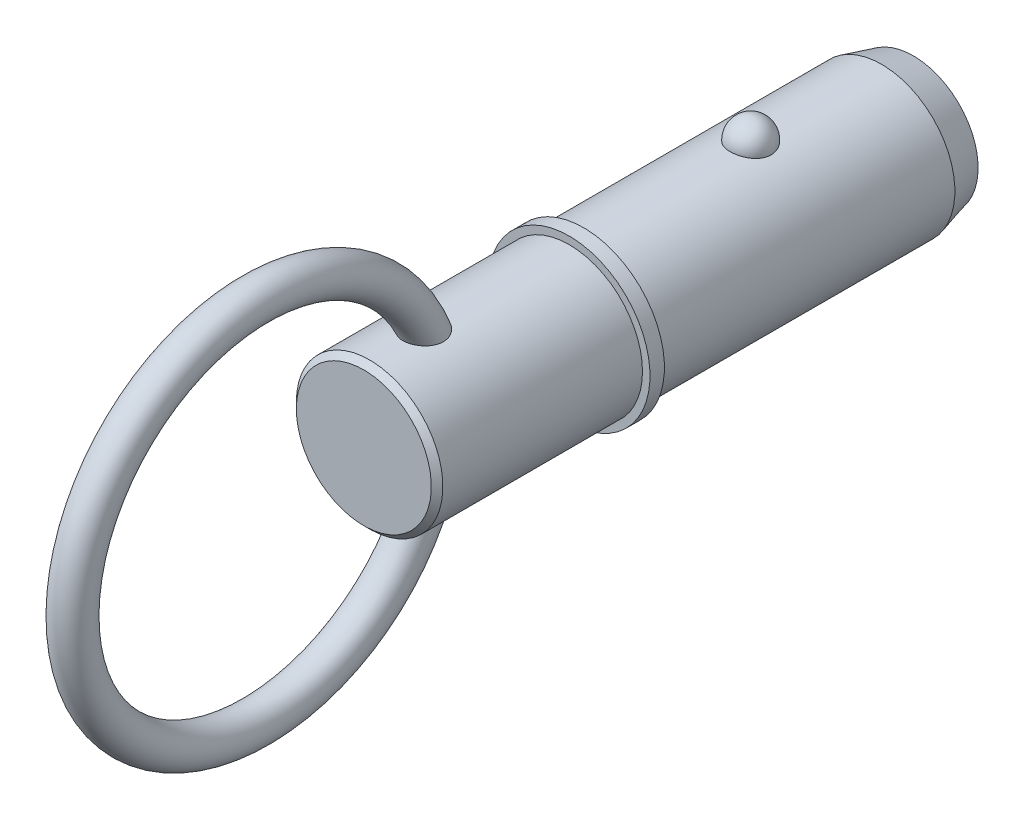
from build123d import *

# Parameters (mm, degrees)
SKETCH2_R           = 12.7
BOSS_EXTRUDE1_DEPTH = 25.4
BOSS_EXTRUDE2_START = 31.75
SKETCH3_R           = 12.7
BOSS_EXTRUDE2_DEPTH = 31.75
CHAMFER1_SIZE       = 5.5
CHAMFER1_SIZE2      = 1.473720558
SKETCH20_W          = 2.5
SKETCH20_H          = 14
SKETCH21_R          = 12.7
BOSS_EXTRUDE3_DEPTH = 38.1
CHAMFER2_SIZE       = 1
SKETCH24_R          = 3.25


with BuildPart() as part:
    # Sketch2 → Boss-Extrude1 (new body)
    with BuildSketch(Plane.XY):
        Circle(SKETCH2_R)
    extrude(amount=BOSS_EXTRUDE1_DEPTH)

    # Sketch3 → Boss-Extrude2 (add)
    with BuildSketch(Plane(origin=(0, 0, 0), x_dir=(-1, 0, 0), z_dir=(0, 0, -1)).offset(BOSS_EXTRUDE2_START)):
        Circle(SKETCH3_R)
    extrude(amount=-BOSS_EXTRUDE2_DEPTH)

    # Chamfer1
    chamfer1_edges = [part.edges().sort_by_distance(p)[0] for p in [
        (12.7, 0, -31.75),
    ]]
    chamfer1_side = [part.faces().sort_by_distance(p)[0] for p in [
        (12.7, 0, -15.875),
    ]]
    chamfer(chamfer1_edges, length=CHAMFER1_SIZE, length2=CHAMFER1_SIZE2, reference=chamfer1_side[0])

    # Sketch18 → Revolve1 (revolve)
    with BuildSketch(Plane(origin=(0, 0, 0), x_dir=(0, 0, -1), z_dir=(1, 0, 0))):
        with BuildLine():
            Line((3.56, 16.26), (3.56, 9.14))
            ThreePointArc((3.56, 9.14), (0, 12.7), (3.56, 16.26))
        make_face()
    revolve(axis=Axis((0, 16.26, -3.56), (0, -1, 0)))

    # Sketch20 → Revolve2 (revolve)
    with BuildSketch(Plane(origin=(0, 0, 0), x_dir=(0, 0, -1), z_dir=(1, 0, 0)), mode=Mode.PRIVATE) as revolve2_sk:
        with Locations((-26.65, 7)):
            Rectangle(SKETCH20_W, SKETCH20_H)
    revolve(revolve2_sk.sketch.rotate(Axis((0, 0, 33.728787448), (0, 0, 1)), 90), axis=Axis((0, 0, 33.728787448), (0, 0, 1)))

    # Sketch21 → Boss-Extrude3 (add)
    with BuildSketch(Plane(origin=(0, 0, 25.4), x_dir=(-1, 0, 0), z_dir=(0, 0, -1))):
        Circle(SKETCH21_R)
    extrude(amount=-BOSS_EXTRUDE3_DEPTH)

    # Chamfer2
    chamfer2_edges = [part.edges().sort_by_distance(p)[0] for p in [
        (12.7, 0, 63.5),
    ]]
    chamfer(chamfer2_edges, length=CHAMFER2_SIZE)

    # Sweep1: sweep along a path in Sketch23
    with BuildLine(Plane(origin=(0, 0, 0), x_dir=(0, 0, -1), z_dir=(1, 0, 0))) as sweep1_path:
        CenterArc((-82.25, 0), 31.75, 0, 360)
    # Sketch24 → Sweep1 (sweep)
    with BuildSketch(Plane(origin=(0, 0, 0), x_dir=(1, 0, 0), z_dir=(0, 1, 0))):
        with Locations((0, -50.5)):
            Circle(SKETCH24_R)
    sweep(path=sweep1_path.line)


solid = part.part
